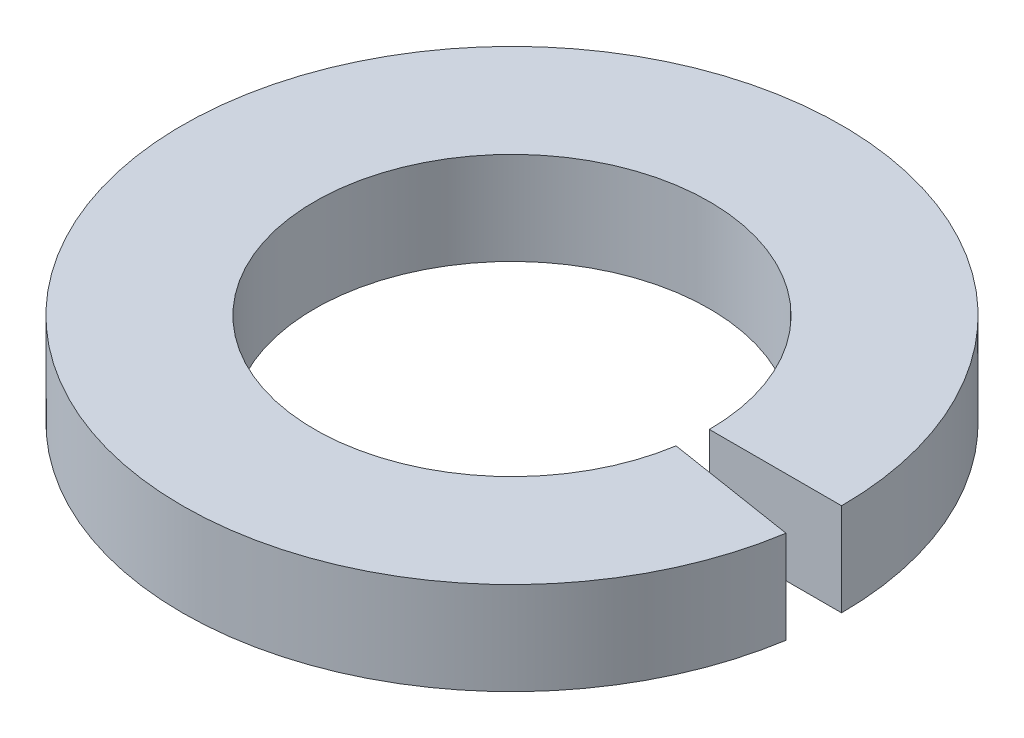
from build123d import *

# Parameters (mm, degrees)
SKETCH1_W          = 1.7018
SKETCH1_H          = 1.1938
BASE_REVOLVE_ANGLE = 351


with BuildPart() as part:
    # Sketch1 → Base-Revolve (revolve)
    with BuildSketch(Plane.XY):
        with Locations((3.3909, 0.5969)):
            Rectangle(SKETCH1_W, SKETCH1_H)
    revolve(axis=Axis((0, -59.69, 0), (0, 1, 0)), revolution_arc=BASE_REVOLVE_ANGLE)


solid = part.part
